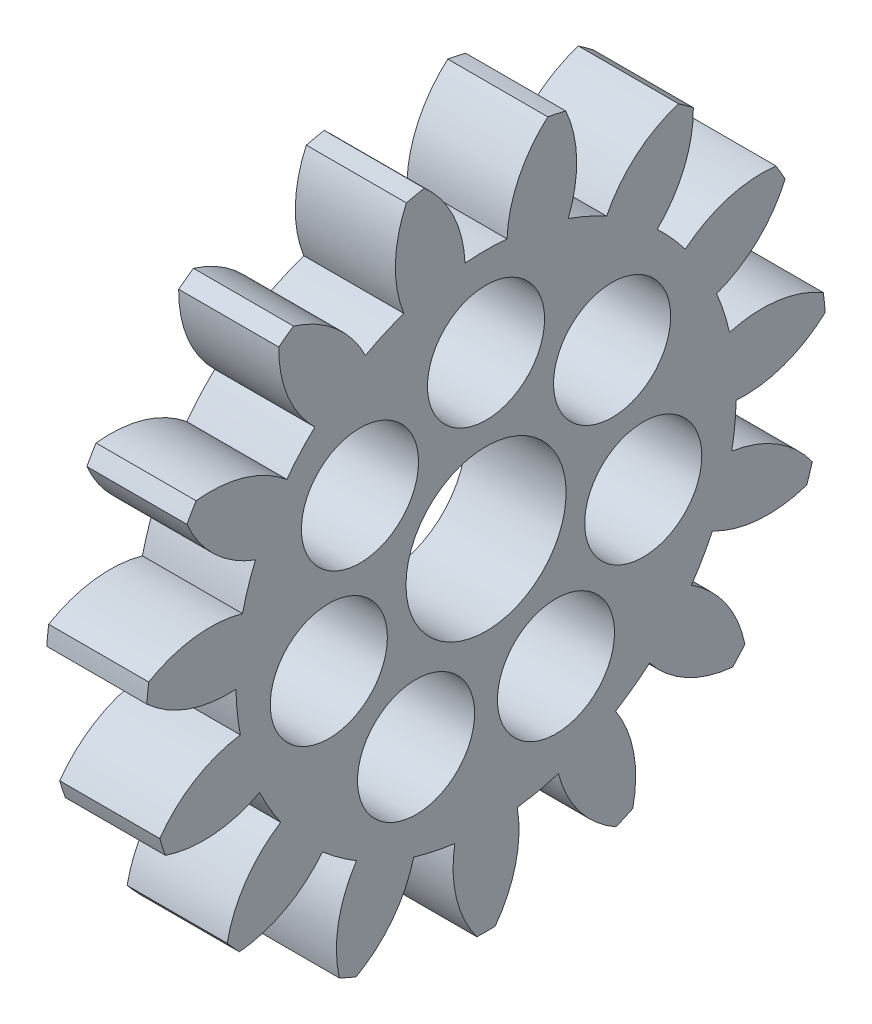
from build123d import *

# Parameters (mm, degrees)
BASPROSKE_W             = 5
BASPROSKE_H             = 17
TOOTHCUT_DEPTH          = 25.556058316
TEETHCUTS_COUNT         = 15
TEETHCUTS_ANGLE         = 336
BORSKE_R                = 4
BORE_DEPTH              = 50.0000508
ESQUISSE1_R             = 2.925694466
ENL_V_MAT_EXTRU_1_DEPTH = 10


with BuildPart() as part:
    # BasProSke → Base-Revolve (revolve)
    with BuildSketch(Plane(origin=(0, 0, 0), x_dir=(1, 0, 0), z_dir=(0, 1, 0)), mode=Mode.PRIVATE) as base_revolve_sk:
        with Locations((2.5, 8.5)):
            Rectangle(BASPROSKE_W, BASPROSKE_H)
    revolve(base_revolve_sk.sketch.rotate(Axis((-10, 0, 0), (1, 0, 0)), 180), axis=Axis((-10, 0, 0), (1, 0, 0)))

    # TooCutSke → ToothCut (cut, through all)
    with BuildSketch(Plane(origin=(0, 0, 0), x_dir=(0, 0, -1), z_dir=(1, 0, 0))):
        with BuildLine():
            ThreePointArc((1.050056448, 12.454813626), (0, 12.499), (-1.050056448, 12.454813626))
            ThreePointArc((-1.050056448, 12.454813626), (-1.638118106, 14.809604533), (-3.110934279, 16.73876737))
            ThreePointArc((-3.110934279, 16.73876737), (0, 17.0254), (3.110934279, 16.73876737))
            ThreePointArc((3.110934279, 16.73876737), (1.638118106, 14.809604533), (1.050056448, 12.454813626))
        make_face()
    toothcut = extrude(amount=TOOTHCUT_DEPTH, mode=Mode.SUBTRACT)

    # TeethCuts: ToothCut ×15 about axis
    teethcuts_axis = Axis((-10, 0, 0), (1, 0, 0))
    for i in range(1, TEETHCUTS_COUNT):
        add(toothcut.rotate(teethcuts_axis, i * TEETHCUTS_ANGLE / (TEETHCUTS_COUNT - 1)), mode=Mode.SUBTRACT)

    # BorSke → Bore (cut, symmetric)
    with BuildSketch(Plane(origin=(0, 0, 0), x_dir=(0, 0, -1), z_dir=(1, 0, 0))):
        with Locations(Location((0, 0, 0), (0, 0, 180))):
            Circle(BORSKE_R)
    extrude(amount=BORE_DEPTH, both=True, mode=Mode.SUBTRACT)

    # Esquisse1 → Enl_v. mat.-Extru.1 (cut)
    with BuildSketch(Plane(origin=(5, 0, 0), x_dir=(0, 0, -1), z_dir=(1, 0, 0))):
        with Locations((0, 8.056762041)):
            Circle(ESQUISSE1_R)
        with Locations((6.299030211, 5.023308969)):
            Circle(ESQUISSE1_R)
        with Locations((7.854762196, -1.792798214)):
            Circle(ESQUISSE1_R)
        with Locations((3.49569804, -7.258891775)):
            Circle(ESQUISSE1_R)
        with Locations((-3.49569804, -7.258891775)):
            Circle(ESQUISSE1_R)
        with Locations((-7.854762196, -1.792798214)):
            Circle(ESQUISSE1_R)
        with Locations((-6.299030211, 5.023308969)):
            Circle(ESQUISSE1_R)
    extrude(amount=-ENL_V_MAT_EXTRU_1_DEPTH, mode=Mode.SUBTRACT)


solid = part.part
